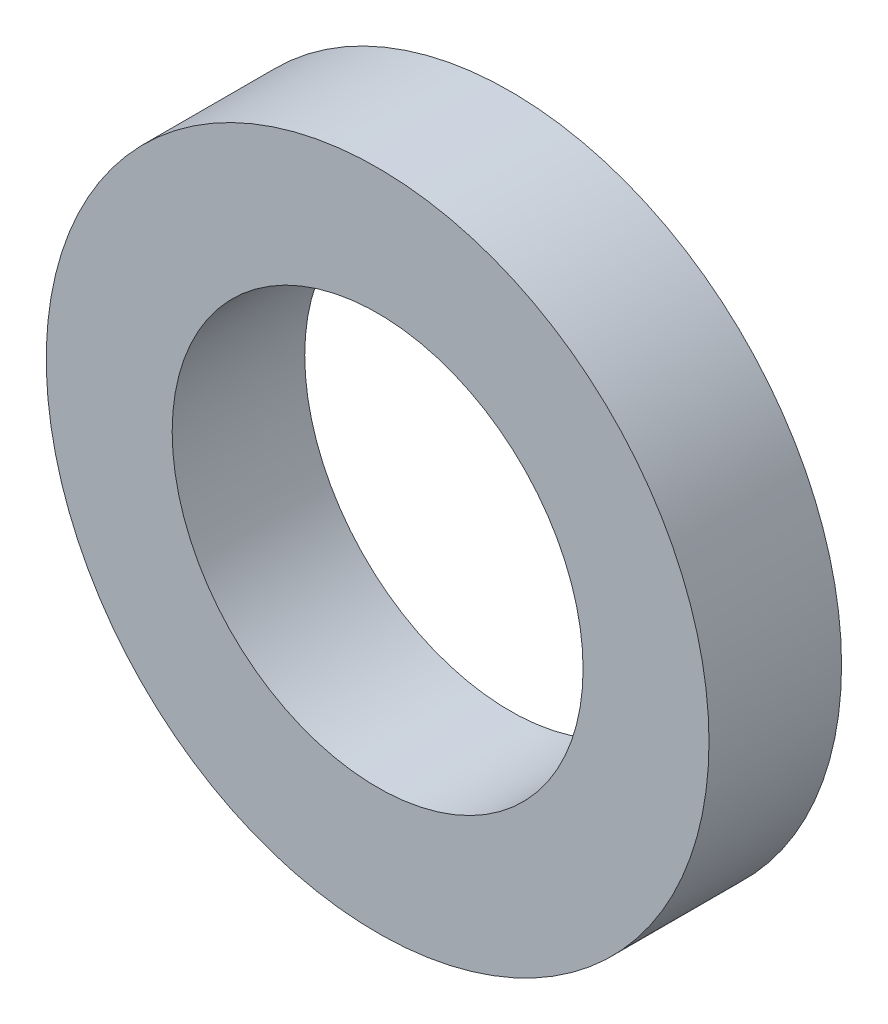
from build123d import *

# Parameters (mm, degrees)
CROQUIS1_R              = 12.5
CROQUIS1_R_2            = 7.75
SALIENTE_EXTRUIR1_DEPTH = 5


with BuildPart() as part:
    # Croquis1 → Saliente-Extruir1 (new body)
    with BuildSketch(Plane.XY):
        Circle(CROQUIS1_R)
        Circle(CROQUIS1_R_2, mode=Mode.SUBTRACT)
    extrude(amount=SALIENTE_EXTRUIR1_DEPTH)


solid = part.part
